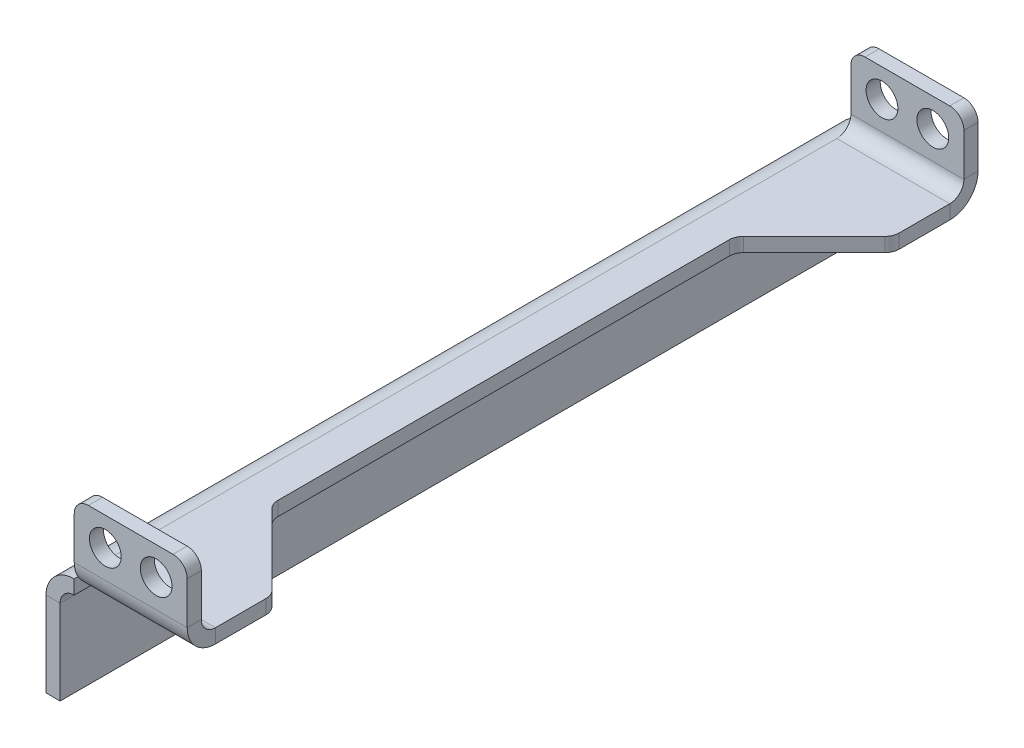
ISO-10303-21;
HEADER;
FILE_DESCRIPTION(('STEP AP214'),'2;1');
FILE_NAME('part.step','',(''),(''),'','','');
FILE_SCHEMA(('AUTOMOTIVE_DESIGN { 1 0 10303 214 1 1 1 1 }'));
ENDSEC;
DATA;
#1=APPLICATION_CONTEXT('core data for automotive mechanical design processes');
#2=APPLICATION_PROTOCOL_DEFINITION('international standard','automotive_design',2000,#1);
#3=PRODUCT_CONTEXT('',#1,'mechanical');
#4=PRODUCT('Part','Part','',(#3));
#5=PRODUCT_RELATED_PRODUCT_CATEGORY('part','',(#4));
#6=PRODUCT_DEFINITION_FORMATION('','',#4);
#7=PRODUCT_DEFINITION_CONTEXT('part definition',#1,'design');
#8=PRODUCT_DEFINITION('design','',#6,#7);
#9=PRODUCT_DEFINITION_SHAPE('','',#8);
#10=(LENGTH_UNIT() NAMED_UNIT(*) SI_UNIT(.MILLI.,.METRE.));
#11=(NAMED_UNIT(*) PLANE_ANGLE_UNIT() SI_UNIT($,.RADIAN.));
#12=(NAMED_UNIT(*) SI_UNIT($,.STERADIAN.) SOLID_ANGLE_UNIT());
#13=UNCERTAINTY_MEASURE_WITH_UNIT(LENGTH_MEASURE(1.E-05),#10,'distance_accuracy_value','');
#14=(GEOMETRIC_REPRESENTATION_CONTEXT(3) GLOBAL_UNCERTAINTY_ASSIGNED_CONTEXT((#13)) GLOBAL_UNIT_ASSIGNED_CONTEXT((#10,
#11,#12)) REPRESENTATION_CONTEXT('',''));
#15=CARTESIAN_POINT('',(0.,0.,0.));
#16=DIRECTION('',(0.,0.,1.));
#17=DIRECTION('',(1.,0.,0.));
#18=AXIS2_PLACEMENT_3D('',#15,#16,#17);
#19=CARTESIAN_POINT('',(-1.00520085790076E-13,25.4,0.));
#20=DIRECTION('',(0.,-1.,0.));
#21=DIRECTION('',(1.,0.,0.));
#22=AXIS2_PLACEMENT_3D('',#19,#20,#21);
#23=PLANE('',#22);
#24=DIRECTION('',(0.707106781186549,0.,-0.707106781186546));
#25=VECTOR('',#24,1.);
#26=CARTESIAN_POINT('',(-19.0500000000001,25.3999999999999,-19.0500000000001));
#27=LINE('',#26,#25);
#28=CARTESIAN_POINT('',(14.8999359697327,25.4,-52.9999359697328));
#29=VERTEX_POINT('',#28);
#30=CARTESIAN_POINT('',(30.8200640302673,25.4000000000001,-68.9200640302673));
#31=VERTEX_POINT('',#30);
#32=EDGE_CURVE('E761',#29,#31,#27,.T.);
#33=ORIENTED_EDGE('',*,*,#32,.T.);
#34=CARTESIAN_POINT('',(28.575,25.4000000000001,-71.1651280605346));
#35=DIRECTION('',(0.,-1.,0.));
#36=DIRECTION('',(1.,0.,0.));
#37=AXIS2_PLACEMENT_3D('',#34,#35,#36);
#38=CIRCLE('',#37,3.175);
#39=CARTESIAN_POINT('',(31.75,25.4000000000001,-71.1651280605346));
#40=VERTEX_POINT('',#39);
#41=EDGE_CURVE('E698',#31,#40,#38,.F.);
#42=ORIENTED_EDGE('',*,*,#41,.T.);
#43=DIRECTION('',(0.,0.,-1.));
#44=VECTOR('',#43,1.);
#45=CARTESIAN_POINT('',(31.75,25.4000000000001,0.));
#46=LINE('',#45,#44);
#47=CARTESIAN_POINT('',(31.75,25.4000000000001,-82.55));
#48=VERTEX_POINT('',#47);
#49=EDGE_CURVE('E544',#40,#48,#46,.T.);
#50=ORIENTED_EDGE('',*,*,#49,.T.);
#51=DIRECTION('',(-1.,0.,0.));
#52=VECTOR('',#51,1.);
#53=CARTESIAN_POINT('',(6.34999999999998,25.4,-82.55));
#54=LINE('',#53,#52);
#55=CARTESIAN_POINT('',(6.34999999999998,25.4,-82.55));
#56=VERTEX_POINT('',#55);
#57=EDGE_CURVE('E519',#56,#48,#54,.F.);
#58=ORIENTED_EDGE('',*,*,#57,.F.);
#59=DIRECTION('',(0.,0.,1.));
#60=VECTOR('',#59,1.);
#61=CARTESIAN_POINT('',(6.34999999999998,25.4,-88.9));
#62=LINE('',#61,#60);
#63=CARTESIAN_POINT('',(6.34999999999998,25.4,82.55));
#64=VERTEX_POINT('',#63);
#65=EDGE_CURVE('E555',#64,#56,#62,.F.);
#66=ORIENTED_EDGE('',*,*,#65,.F.);
#67=DIRECTION('',(1.,0.,0.));
#68=VECTOR('',#67,1.);
#69=CARTESIAN_POINT('',(31.75,25.4000000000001,82.55));
#70=LINE('',#69,#68);
#71=CARTESIAN_POINT('',(31.75,25.4000000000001,82.55));
#72=VERTEX_POINT('',#71);
#73=EDGE_CURVE('E455',#72,#64,#70,.F.);
#74=ORIENTED_EDGE('',*,*,#73,.F.);
#75=CARTESIAN_POINT('',(31.75,25.4000000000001,71.1651280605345));
#76=VERTEX_POINT('',#75);
#77=EDGE_CURVE('E539',#72,#76,#46,.T.);
#78=ORIENTED_EDGE('',*,*,#77,.T.);
#79=CARTESIAN_POINT('',(28.575,25.4000000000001,71.1651280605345));
#80=DIRECTION('',(0.,-1.,0.));
#81=DIRECTION('',(1.,0.,0.));
#82=AXIS2_PLACEMENT_3D('',#79,#80,#81);
#83=CIRCLE('',#82,3.175);
#84=CARTESIAN_POINT('',(30.8200640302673,25.4000000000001,68.9200640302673));
#85=VERTEX_POINT('',#84);
#86=EDGE_CURVE('E695',#76,#85,#83,.F.);
#87=ORIENTED_EDGE('',*,*,#86,.T.);
#88=DIRECTION('',(-0.707106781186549,0.,-0.707106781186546));
#89=VECTOR('',#88,1.);
#90=CARTESIAN_POINT('',(-19.0500000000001,25.3999999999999,19.0500000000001));
#91=LINE('',#90,#89);
#92=CARTESIAN_POINT('',(14.8999359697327,25.4,52.9999359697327));
#93=VERTEX_POINT('',#92);
#94=EDGE_CURVE('E734',#85,#93,#91,.T.);
#95=ORIENTED_EDGE('',*,*,#94,.T.);
#96=CARTESIAN_POINT('',(17.145,25.4,50.7548719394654));
#97=DIRECTION('',(0.,-1.,0.));
#98=DIRECTION('',(1.,0.,0.));
#99=AXIS2_PLACEMENT_3D('',#96,#97,#98);
#100=CIRCLE('',#99,3.175);
#101=CARTESIAN_POINT('',(13.97,25.4,50.7548719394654));
#102=VERTEX_POINT('',#101);
#103=EDGE_CURVE('E13',#93,#102,#100,.T.);
#104=ORIENTED_EDGE('',*,*,#103,.T.);
#105=DIRECTION('',(0.,0.,-1.));
#106=VECTOR('',#105,1.);
#107=CARTESIAN_POINT('',(13.97,25.4,0.));
#108=LINE('',#107,#106);
#109=CARTESIAN_POINT('',(13.97,25.4,-50.7548719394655));
#110=VERTEX_POINT('',#109);
#111=EDGE_CURVE('E753',#102,#110,#108,.T.);
#112=ORIENTED_EDGE('',*,*,#111,.T.);
#113=CARTESIAN_POINT('',(17.145,25.4,-50.7548719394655));
#114=DIRECTION('',(0.,-1.,0.));
#115=DIRECTION('',(1.,0.,0.));
#116=AXIS2_PLACEMENT_3D('',#113,#114,#115);
#117=CIRCLE('',#116,3.175);
#118=EDGE_CURVE('E720',#110,#29,#117,.T.);
#119=ORIENTED_EDGE('',*,*,#118,.T.);
#120=EDGE_LOOP('',(#33,#42,#50,#58,#66,#74,#78,#87,#95,#104,#112,#119));
#121=FACE_BOUND('',#120,.T.);
#122=ADVANCED_FACE('F108',(#121),#23,.F.);
#123=CARTESIAN_POINT('',(0.,22.225,0.));
#124=DIRECTION('',(0.,-1.,0.));
#125=DIRECTION('',(1.,0.,0.));
#126=AXIS2_PLACEMENT_3D('',#123,#124,#125);
#127=PLANE('',#126);
#128=DIRECTION('',(0.,0.,1.));
#129=VECTOR('',#128,1.);
#130=CARTESIAN_POINT('',(31.75,22.2250000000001,-88.9));
#131=LINE('',#130,#129);
#132=CARTESIAN_POINT('',(31.75,22.2250000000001,-71.1651280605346));
#133=VERTEX_POINT('',#132);
#134=CARTESIAN_POINT('',(31.75,22.2250000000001,-82.55));
#135=VERTEX_POINT('',#134);
#136=EDGE_CURVE('E549',#133,#135,#131,.F.);
#137=ORIENTED_EDGE('',*,*,#136,.F.);
#138=CARTESIAN_POINT('',(28.575,22.2250000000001,-71.1651280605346));
#139=DIRECTION('',(0.,-1.,0.));
#140=DIRECTION('',(1.,0.,0.));
#141=AXIS2_PLACEMENT_3D('',#138,#139,#140);
#142=CIRCLE('',#141,3.175);
#143=CARTESIAN_POINT('',(30.8200640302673,22.2250000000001,-68.9200640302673));
#144=VERTEX_POINT('',#143);
#145=EDGE_CURVE('E685',#133,#144,#142,.T.);
#146=ORIENTED_EDGE('',*,*,#145,.T.);
#147=DIRECTION('',(0.707106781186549,0.,-0.707106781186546));
#148=VECTOR('',#147,1.);
#149=CARTESIAN_POINT('',(-19.0500000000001,22.2249999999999,-19.0500000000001));
#150=LINE('',#149,#148);
#151=CARTESIAN_POINT('',(14.8999359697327,22.225,-52.9999359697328));
#152=VERTEX_POINT('',#151);
#153=EDGE_CURVE('E752',#152,#144,#150,.T.);
#154=ORIENTED_EDGE('',*,*,#153,.F.);
#155=CARTESIAN_POINT('',(17.145,22.225,-50.7548719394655));
#156=DIRECTION('',(0.,-1.,0.));
#157=DIRECTION('',(1.,0.,0.));
#158=AXIS2_PLACEMENT_3D('',#155,#156,#157);
#159=CIRCLE('',#158,3.175);
#160=CARTESIAN_POINT('',(13.97,22.225,-50.7548719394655));
#161=VERTEX_POINT('',#160);
#162=EDGE_CURVE('E717',#152,#161,#159,.F.);
#163=ORIENTED_EDGE('',*,*,#162,.T.);
#164=DIRECTION('',(0.,0.,1.));
#165=VECTOR('',#164,1.);
#166=CARTESIAN_POINT('',(13.97,22.225,0.));
#167=LINE('',#166,#165);
#168=CARTESIAN_POINT('',(13.97,22.225,50.7548719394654));
#169=VERTEX_POINT('',#168);
#170=EDGE_CURVE('E443',#169,#161,#167,.F.);
#171=ORIENTED_EDGE('',*,*,#170,.F.);
#172=CARTESIAN_POINT('',(17.145,22.225,50.7548719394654));
#173=DIRECTION('',(0.,-1.,0.));
#174=DIRECTION('',(1.,0.,0.));
#175=AXIS2_PLACEMENT_3D('',#172,#173,#174);
#176=CIRCLE('',#175,3.175);
#177=CARTESIAN_POINT('',(14.8999359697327,22.225,52.9999359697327));
#178=VERTEX_POINT('',#177);
#179=EDGE_CURVE('E118',#169,#178,#176,.F.);
#180=ORIENTED_EDGE('',*,*,#179,.T.);
#181=DIRECTION('',(-0.707106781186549,0.,-0.707106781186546));
#182=VECTOR('',#181,1.);
#183=CARTESIAN_POINT('',(-19.0500000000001,22.2249999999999,19.0500000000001));
#184=LINE('',#183,#182);
#185=CARTESIAN_POINT('',(30.8200640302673,22.2250000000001,68.9200640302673));
#186=VERTEX_POINT('',#185);
#187=EDGE_CURVE('E748',#186,#178,#184,.T.);
#188=ORIENTED_EDGE('',*,*,#187,.F.);
#189=CARTESIAN_POINT('',(28.575,22.2250000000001,71.1651280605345));
#190=DIRECTION('',(0.,-1.,0.));
#191=DIRECTION('',(1.,0.,0.));
#192=AXIS2_PLACEMENT_3D('',#189,#190,#191);
#193=CIRCLE('',#192,3.175);
#194=CARTESIAN_POINT('',(31.75,22.2250000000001,71.1651280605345));
#195=VERTEX_POINT('',#194);
#196=EDGE_CURVE('E682',#186,#195,#193,.T.);
#197=ORIENTED_EDGE('',*,*,#196,.T.);
#198=CARTESIAN_POINT('',(31.75,22.2250000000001,82.55));
#199=VERTEX_POINT('',#198);
#200=EDGE_CURVE('E545',#199,#195,#131,.F.);
#201=ORIENTED_EDGE('',*,*,#200,.F.);
#202=DIRECTION('',(1.,0.,0.));
#203=VECTOR('',#202,1.);
#204=CARTESIAN_POINT('',(31.75,22.2250000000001,82.55));
#205=LINE('',#204,#203);
#206=CARTESIAN_POINT('',(6.34999999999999,22.225,82.55));
#207=VERTEX_POINT('',#206);
#208=EDGE_CURVE('E384',#199,#207,#205,.F.);
#209=ORIENTED_EDGE('',*,*,#208,.T.);
#210=DIRECTION('',(0.,0.,1.));
#211=VECTOR('',#210,1.);
#212=CARTESIAN_POINT('',(6.34999999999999,22.225,-88.9));
#213=LINE('',#212,#211);
#214=CARTESIAN_POINT('',(6.34999999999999,22.225,-82.55));
#215=VERTEX_POINT('',#214);
#216=EDGE_CURVE('E564',#215,#207,#213,.T.);
#217=ORIENTED_EDGE('',*,*,#216,.F.);
#218=DIRECTION('',(-1.,0.,0.));
#219=VECTOR('',#218,1.);
#220=CARTESIAN_POINT('',(6.34999999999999,22.225,-82.55));
#221=LINE('',#220,#219);
#222=EDGE_CURVE('E501',#215,#135,#221,.F.);
#223=ORIENTED_EDGE('',*,*,#222,.T.);
#224=EDGE_LOOP('',(#137,#146,#154,#163,#171,#180,#188,#197,#201,#209,#217,#223));
#225=FACE_BOUND('',#224,.T.);
#226=ADVANCED_FACE('F777',(#225),#127,.T.);
#227=CARTESIAN_POINT('',(31.75,25.4000000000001,-88.9));
#228=DIRECTION('',(-1.,0.,0.));
#229=DIRECTION('',(0.,-1.,0.));
#230=AXIS2_PLACEMENT_3D('',#227,#228,#229);
#231=PLANE('',#230);
#232=ORIENTED_EDGE('',*,*,#49,.F.);
#233=DIRECTION('',(0.,1.,0.));
#234=VECTOR('',#233,1.);
#235=CARTESIAN_POINT('',(31.75,22.2250000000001,-71.1651280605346));
#236=LINE('',#235,#234);
#237=EDGE_CURVE('E678',#40,#133,#236,.F.);
#238=ORIENTED_EDGE('',*,*,#237,.T.);
#239=ORIENTED_EDGE('',*,*,#136,.T.);
#240=DIRECTION('',(0.,-1.,0.));
#241=VECTOR('',#240,1.);
#242=CARTESIAN_POINT('',(31.75,25.4000000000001,-82.55));
#243=LINE('',#242,#241);
#244=EDGE_CURVE('E510',#48,#135,#243,.T.);
#245=ORIENTED_EDGE('',*,*,#244,.F.);
#246=EDGE_LOOP('',(#232,#238,#239,#245));
#247=FACE_BOUND('',#246,.T.);
#248=ADVANCED_FACE('F785',(#247),#231,.F.);
#249=ORIENTED_EDGE('',*,*,#200,.T.);
#250=DIRECTION('',(0.,1.,0.));
#251=VECTOR('',#250,1.);
#252=CARTESIAN_POINT('',(31.75,25.4000000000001,71.1651280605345));
#253=LINE('',#252,#251);
#254=EDGE_CURVE('E714',#195,#76,#253,.T.);
#255=ORIENTED_EDGE('',*,*,#254,.T.);
#256=ORIENTED_EDGE('',*,*,#77,.F.);
#257=DIRECTION('',(0.,-1.,0.));
#258=VECTOR('',#257,1.);
#259=CARTESIAN_POINT('',(31.75,25.4000000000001,82.55));
#260=LINE('',#259,#258);
#261=EDGE_CURVE('E450',#72,#199,#260,.T.);
#262=ORIENTED_EDGE('',*,*,#261,.T.);
#263=EDGE_LOOP('',(#249,#255,#256,#262));
#264=FACE_BOUND('',#263,.T.);
#265=ADVANCED_FACE('F900',(#264),#231,.F.);
#266=CARTESIAN_POINT('',(6.34999999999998,25.4,82.55));
#267=DIRECTION('',(1.,0.,0.));
#268=DIRECTION('',(0.,1.,0.));
#269=AXIS2_PLACEMENT_3D('',#266,#267,#268);
#270=PLANE('',#269);
#271=DIRECTION('',(0.,0.,1.));
#272=VECTOR('',#271,1.);
#273=CARTESIAN_POINT('',(6.34999999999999,22.225,88.9));
#274=LINE('',#273,#272);
#275=CARTESIAN_POINT('',(6.34999999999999,22.225,88.9));
#276=VERTEX_POINT('',#275);
#277=EDGE_CURVE('E529',#276,#207,#274,.F.);
#278=ORIENTED_EDGE('',*,*,#277,.T.);
#279=CARTESIAN_POINT('',(6.34999999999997,28.575,82.55));
#280=DIRECTION('',(1.,0.,0.));
#281=DIRECTION('',(0.,1.,0.));
#282=AXIS2_PLACEMENT_3D('',#279,#280,#281);
#283=CIRCLE('',#282,6.35);
#284=CARTESIAN_POINT('',(6.34999999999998,25.4,88.0492613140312));
#285=VERTEX_POINT('',#284);
#286=EDGE_CURVE('E447',#207,#285,#283,.F.);
#287=ORIENTED_EDGE('',*,*,#286,.T.);
#288=CARTESIAN_POINT('',(6.34999999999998,25.4,88.9));
#289=VERTEX_POINT('',#288);
#290=EDGE_CURVE('E550',#289,#285,#62,.F.);
#291=ORIENTED_EDGE('',*,*,#290,.F.);
#292=DIRECTION('',(0.,-1.,0.));
#293=VECTOR('',#292,1.);
#294=CARTESIAN_POINT('',(6.34999999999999,22.225,88.9));
#295=LINE('',#294,#293);
#296=EDGE_CURVE('E556',#276,#289,#295,.F.);
#297=ORIENTED_EDGE('',*,*,#296,.F.);
#298=EDGE_LOOP('',(#278,#287,#291,#297));
#299=FACE_BOUND('',#298,.T.);
#300=ADVANCED_FACE('F990',(#299),#270,.T.);
#301=CARTESIAN_POINT('',(6.34999999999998,25.4,-88.9));
#302=DIRECTION('',(1.,0.,0.));
#303=DIRECTION('',(0.,1.,0.));
#304=AXIS2_PLACEMENT_3D('',#301,#302,#303);
#305=PLANE('',#304);
#306=DIRECTION('',(0.,0.,1.));
#307=VECTOR('',#306,1.);
#308=CARTESIAN_POINT('',(6.34999999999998,25.4,-88.9));
#309=LINE('',#308,#307);
#310=CARTESIAN_POINT('',(6.34999999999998,25.4,-88.9));
#311=VERTEX_POINT('',#310);
#312=CARTESIAN_POINT('',(6.34999999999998,25.4,-88.0492613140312));
#313=VERTEX_POINT('',#312);
#314=EDGE_CURVE('E534',#311,#313,#309,.T.);
#315=ORIENTED_EDGE('',*,*,#314,.T.);
#316=CARTESIAN_POINT('',(6.34999999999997,28.575,-82.55));
#317=DIRECTION('',(-1.,0.,0.));
#318=DIRECTION('',(0.,-1.,0.));
#319=AXIS2_PLACEMENT_3D('',#316,#317,#318);
#320=CIRCLE('',#319,6.35);
#321=EDGE_CURVE('E515',#313,#215,#320,.T.);
#322=ORIENTED_EDGE('',*,*,#321,.T.);
#323=CARTESIAN_POINT('',(6.34999999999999,22.225,-88.9));
#324=VERTEX_POINT('',#323);
#325=EDGE_CURVE('E560',#324,#215,#213,.T.);
#326=ORIENTED_EDGE('',*,*,#325,.F.);
#327=DIRECTION('',(0.,-1.,0.));
#328=VECTOR('',#327,1.);
#329=CARTESIAN_POINT('',(6.34999999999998,25.4,-88.9));
#330=LINE('',#329,#328);
#331=EDGE_CURVE('E538',#324,#311,#330,.F.);
#332=ORIENTED_EDGE('',*,*,#331,.T.);
#333=EDGE_LOOP('',(#315,#322,#326,#332));
#334=FACE_BOUND('',#333,.T.);
#335=ADVANCED_FACE('F895',(#334),#305,.T.);
#336=CARTESIAN_POINT('',(3.175,0.,88.9));
#337=DIRECTION('',(-1.,0.,0.));
#338=DIRECTION('',(0.,0.,1.));
#339=AXIS2_PLACEMENT_3D('',#336,#337,#338);
#340=PLANE('',#339);
#341=DIRECTION('',(0.,0.,1.));
#342=VECTOR('',#341,1.);
#343=CARTESIAN_POINT('',(3.175,19.05,88.9));
#344=LINE('',#343,#342);
#345=CARTESIAN_POINT('',(3.175,19.05,88.9));
#346=VERTEX_POINT('',#345);
#347=CARTESIAN_POINT('',(3.175,19.05,-88.9));
#348=VERTEX_POINT('',#347);
#349=EDGE_CURVE('E585',#346,#348,#344,.F.);
#350=ORIENTED_EDGE('',*,*,#349,.F.);
#351=DIRECTION('',(0.,1.,0.));
#352=VECTOR('',#351,1.);
#353=CARTESIAN_POINT('',(3.175,0.,88.9));
#354=LINE('',#353,#352);
#355=CARTESIAN_POINT('',(3.175,0.,88.9));
#356=VERTEX_POINT('',#355);
#357=EDGE_CURVE('E599',#356,#346,#354,.T.);
#358=ORIENTED_EDGE('',*,*,#357,.F.);
#359=DIRECTION('',(0.,0.,-1.));
#360=VECTOR('',#359,1.);
#361=CARTESIAN_POINT('',(3.175,0.,88.9));
#362=LINE('',#361,#360);
#363=CARTESIAN_POINT('',(3.175,0.,-88.9));
#364=VERTEX_POINT('',#363);
#365=EDGE_CURVE('E612',#356,#364,#362,.T.);
#366=ORIENTED_EDGE('',*,*,#365,.T.);
#367=DIRECTION('',(0.,1.,0.));
#368=VECTOR('',#367,1.);
#369=CARTESIAN_POINT('',(3.175,0.,-88.9));
#370=LINE('',#369,#368);
#371=EDGE_CURVE('E595',#364,#348,#370,.T.);
#372=ORIENTED_EDGE('',*,*,#371,.T.);
#373=EDGE_LOOP('',(#350,#358,#366,#372));
#374=FACE_BOUND('',#373,.T.);
#375=ADVANCED_FACE('F930',(#374),#340,.F.);
#376=CARTESIAN_POINT('',(0.,0.,88.9));
#377=DIRECTION('',(-1.,0.,0.));
#378=DIRECTION('',(0.,0.,1.));
#379=AXIS2_PLACEMENT_3D('',#376,#377,#378);
#380=PLANE('',#379);
#381=DIRECTION('',(0.,1.,0.));
#382=VECTOR('',#381,1.);
#383=CARTESIAN_POINT('',(0.,0.,88.9));
#384=LINE('',#383,#382);
#385=CARTESIAN_POINT('',(0.,0.,88.9));
#386=VERTEX_POINT('',#385);
#387=CARTESIAN_POINT('',(0.,19.05,88.9));
#388=VERTEX_POINT('',#387);
#389=EDGE_CURVE('E603',#386,#388,#384,.T.);
#390=ORIENTED_EDGE('',*,*,#389,.T.);
#391=DIRECTION('',(0.,0.,1.));
#392=VECTOR('',#391,1.);
#393=CARTESIAN_POINT('',(0.,19.05,88.9));
#394=LINE('',#393,#392);
#395=CARTESIAN_POINT('',(0.,19.05,-88.9));
#396=VERTEX_POINT('',#395);
#397=EDGE_CURVE('E568',#388,#396,#394,.F.);
#398=ORIENTED_EDGE('',*,*,#397,.T.);
#399=DIRECTION('',(0.,1.,0.));
#400=VECTOR('',#399,1.);
#401=CARTESIAN_POINT('',(0.,0.,-88.9));
#402=LINE('',#401,#400);
#403=CARTESIAN_POINT('',(0.,0.,-88.9));
#404=VERTEX_POINT('',#403);
#405=EDGE_CURVE('E616',#404,#396,#402,.T.);
#406=ORIENTED_EDGE('',*,*,#405,.F.);
#407=DIRECTION('',(0.,0.,-1.));
#408=VECTOR('',#407,1.);
#409=CARTESIAN_POINT('',(0.,0.,88.9));
#410=LINE('',#409,#408);
#411=EDGE_CURVE('E625',#386,#404,#410,.T.);
#412=ORIENTED_EDGE('',*,*,#411,.F.);
#413=EDGE_LOOP('',(#390,#398,#406,#412));
#414=FACE_BOUND('',#413,.T.);
#415=ADVANCED_FACE('F920',(#414),#380,.T.);
#416=CARTESIAN_POINT('',(0.,0.,88.9));
#417=DIRECTION('',(0.,0.,-1.));
#418=DIRECTION('',(-1.,0.,0.));
#419=AXIS2_PLACEMENT_3D('',#416,#417,#418);
#420=PLANE('',#419);
#421=DIRECTION('',(-1.,0.,0.));
#422=VECTOR('',#421,1.);
#423=CARTESIAN_POINT('',(3.175,19.05,88.9));
#424=LINE('',#423,#422);
#425=EDGE_CURVE('E577',#346,#388,#424,.T.);
#426=ORIENTED_EDGE('',*,*,#425,.T.);
#427=ORIENTED_EDGE('',*,*,#389,.F.);
#428=DIRECTION('',(-1.,0.,0.));
#429=VECTOR('',#428,1.);
#430=CARTESIAN_POINT('',(3.175,0.,88.9));
#431=LINE('',#430,#429);
#432=EDGE_CURVE('E608',#356,#386,#431,.T.);
#433=ORIENTED_EDGE('',*,*,#432,.F.);
#434=ORIENTED_EDGE('',*,*,#357,.T.);
#435=EDGE_LOOP('',(#426,#427,#433,#434));
#436=FACE_BOUND('',#435,.T.);
#437=ADVANCED_FACE('F916',(#436),#420,.F.);
#438=CARTESIAN_POINT('',(3.175,0.,88.9));
#439=DIRECTION('',(0.,-1.,0.));
#440=DIRECTION('',(0.,0.,-1.));
#441=AXIS2_PLACEMENT_3D('',#438,#439,#440);
#442=PLANE('',#441);
#443=DIRECTION('',(-1.,0.,0.));
#444=VECTOR('',#443,1.);
#445=CARTESIAN_POINT('',(3.175,0.,-88.9));
#446=LINE('',#445,#444);
#447=EDGE_CURVE('E604',#364,#404,#446,.T.);
#448=ORIENTED_EDGE('',*,*,#447,.F.);
#449=ORIENTED_EDGE('',*,*,#365,.F.);
#450=ORIENTED_EDGE('',*,*,#432,.T.);
#451=ORIENTED_EDGE('',*,*,#411,.T.);
#452=EDGE_LOOP('',(#448,#449,#450,#451));
#453=FACE_BOUND('',#452,.T.);
#454=ADVANCED_FACE('F919',(#453),#442,.T.);
#455=CARTESIAN_POINT('',(0.,0.,-88.9));
#456=DIRECTION('',(0.,0.,-1.));
#457=DIRECTION('',(-1.,0.,0.));
#458=AXIS2_PLACEMENT_3D('',#455,#456,#457);
#459=PLANE('',#458);
#460=DIRECTION('',(-1.,0.,0.));
#461=VECTOR('',#460,1.);
#462=CARTESIAN_POINT('',(3.175,19.05,-88.9));
#463=LINE('',#462,#461);
#464=EDGE_CURVE('E591',#348,#396,#463,.T.);
#465=ORIENTED_EDGE('',*,*,#464,.F.);
#466=ORIENTED_EDGE('',*,*,#371,.F.);
#467=ORIENTED_EDGE('',*,*,#447,.T.);
#468=ORIENTED_EDGE('',*,*,#405,.T.);
#469=EDGE_LOOP('',(#465,#466,#467,#468));
#470=FACE_BOUND('',#469,.T.);
#471=ADVANCED_FACE('F911',(#470),#459,.T.);
#472=CARTESIAN_POINT('',(6.35,19.05,-88.9));
#473=DIRECTION('',(0.,0.,-1.));
#474=DIRECTION('',(-1.,0.,0.));
#475=AXIS2_PLACEMENT_3D('',#472,#473,#474);
#476=PLANE('',#475);
#477=ORIENTED_EDGE('',*,*,#331,.F.);
#478=CARTESIAN_POINT('',(6.35,19.05,-88.9));
#479=DIRECTION('',(0.,0.,1.));
#480=DIRECTION('',(1.,0.,0.));
#481=AXIS2_PLACEMENT_3D('',#478,#479,#480);
#482=CIRCLE('',#481,3.175);
#483=EDGE_CURVE('E581',#348,#324,#482,.F.);
#484=ORIENTED_EDGE('',*,*,#483,.F.);
#485=ORIENTED_EDGE('',*,*,#464,.T.);
#486=CARTESIAN_POINT('',(6.35,19.05,-88.9));
#487=DIRECTION('',(0.,0.,1.));
#488=DIRECTION('',(1.,0.,0.));
#489=AXIS2_PLACEMENT_3D('',#486,#487,#488);
#490=CIRCLE('',#489,6.35);
#491=EDGE_CURVE('E572',#396,#311,#490,.F.);
#492=ORIENTED_EDGE('',*,*,#491,.T.);
#493=EDGE_LOOP('',(#477,#484,#485,#492));
#494=FACE_BOUND('',#493,.T.);
#495=ADVANCED_FACE('F908',(#494),#476,.T.);
#496=CARTESIAN_POINT('',(6.35,19.05,88.9));
#497=DIRECTION('',(0.,0.,-1.));
#498=DIRECTION('',(-1.,0.,0.));
#499=AXIS2_PLACEMENT_3D('',#496,#497,#498);
#500=PLANE('',#499);
#501=CARTESIAN_POINT('',(6.35,19.05,88.9));
#502=DIRECTION('',(0.,0.,1.));
#503=DIRECTION('',(1.,0.,0.));
#504=AXIS2_PLACEMENT_3D('',#501,#502,#503);
#505=CIRCLE('',#504,3.175);
#506=EDGE_CURVE('E543',#276,#346,#505,.T.);
#507=ORIENTED_EDGE('',*,*,#506,.F.);
#508=ORIENTED_EDGE('',*,*,#296,.T.);
#509=CARTESIAN_POINT('',(6.35,19.05,88.9));
#510=DIRECTION('',(0.,0.,1.));
#511=DIRECTION('',(1.,0.,0.));
#512=AXIS2_PLACEMENT_3D('',#509,#510,#511);
#513=CIRCLE('',#512,6.35);
#514=EDGE_CURVE('E573',#289,#388,#513,.T.);
#515=ORIENTED_EDGE('',*,*,#514,.T.);
#516=ORIENTED_EDGE('',*,*,#425,.F.);
#517=EDGE_LOOP('',(#507,#508,#515,#516));
#518=FACE_BOUND('',#517,.T.);
#519=ADVANCED_FACE('F904',(#518),#500,.F.);
#520=CARTESIAN_POINT('',(6.35,19.05,88.9));
#521=DIRECTION('',(0.,0.,1.));
#522=DIRECTION('',(0.,1.,0.));
#523=AXIS2_PLACEMENT_3D('',#520,#521,#522);
#524=CYLINDRICAL_SURFACE('',#523,6.35);
#525=ORIENTED_EDGE('',*,*,#397,.F.);
#526=ORIENTED_EDGE('',*,*,#514,.F.);
#527=ORIENTED_EDGE('',*,*,#290,.T.);
#528=EDGE_CURVE('E554',#285,#64,#62,.F.);
#529=ORIENTED_EDGE('',*,*,#528,.T.);
#530=ORIENTED_EDGE('',*,*,#65,.T.);
#531=EDGE_CURVE('E533',#313,#56,#309,.T.);
#532=ORIENTED_EDGE('',*,*,#531,.F.);
#533=ORIENTED_EDGE('',*,*,#314,.F.);
#534=ORIENTED_EDGE('',*,*,#491,.F.);
#535=EDGE_LOOP('',(#525,#526,#527,#529,#530,#532,#533,#534));
#536=FACE_BOUND('',#535,.T.);
#537=ADVANCED_FACE('F834',(#536),#524,.T.);
#538=CARTESIAN_POINT('',(6.35,19.05,88.9));
#539=DIRECTION('',(0.,0.,1.));
#540=DIRECTION('',(0.,1.,0.));
#541=AXIS2_PLACEMENT_3D('',#538,#539,#540);
#542=CYLINDRICAL_SURFACE('',#541,3.175);
#543=ORIENTED_EDGE('',*,*,#349,.T.);
#544=ORIENTED_EDGE('',*,*,#483,.T.);
#545=ORIENTED_EDGE('',*,*,#325,.T.);
#546=ORIENTED_EDGE('',*,*,#216,.T.);
#547=ORIENTED_EDGE('',*,*,#277,.F.);
#548=ORIENTED_EDGE('',*,*,#506,.T.);
#549=EDGE_LOOP('',(#543,#544,#545,#546,#547,#548));
#550=FACE_BOUND('',#549,.T.);
#551=ADVANCED_FACE('F903',(#550),#542,.F.);
#552=CARTESIAN_POINT('',(31.75,28.5750000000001,-82.55));
#553=DIRECTION('',(1.,0.,0.));
#554=DIRECTION('',(0.,1.,0.));
#555=AXIS2_PLACEMENT_3D('',#552,#553,#554);
#556=PLANE('',#555);
#557=DIRECTION('',(0.,0.,1.));
#558=VECTOR('',#557,1.);
#559=CARTESIAN_POINT('',(31.75,28.5750000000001,-88.9));
#560=LINE('',#559,#558);
#561=CARTESIAN_POINT('',(31.75,28.5750000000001,-85.725));
#562=VERTEX_POINT('',#561);
#563=CARTESIAN_POINT('',(31.75,28.575,-88.9));
#564=VERTEX_POINT('',#563);
#565=EDGE_CURVE('E463',#562,#564,#560,.F.);
#566=ORIENTED_EDGE('',*,*,#565,.F.);
#567=CARTESIAN_POINT('',(31.75,28.5750000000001,-82.55));
#568=DIRECTION('',(-1.,0.,0.));
#569=DIRECTION('',(0.,-1.,0.));
#570=AXIS2_PLACEMENT_3D('',#567,#568,#569);
#571=CIRCLE('',#570,3.175);
#572=EDGE_CURVE('E514',#48,#562,#571,.F.);
#573=ORIENTED_EDGE('',*,*,#572,.F.);
#574=ORIENTED_EDGE('',*,*,#244,.T.);
#575=CARTESIAN_POINT('',(31.75,28.5750000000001,-82.55));
#576=DIRECTION('',(-1.,0.,0.));
#577=DIRECTION('',(0.,-1.,0.));
#578=AXIS2_PLACEMENT_3D('',#575,#576,#577);
#579=CIRCLE('',#578,6.35);
#580=EDGE_CURVE('E505',#135,#564,#579,.F.);
#581=ORIENTED_EDGE('',*,*,#580,.T.);
#582=EDGE_LOOP('',(#566,#573,#574,#581));
#583=FACE_BOUND('',#582,.T.);
#584=ADVANCED_FACE('F845',(#583),#556,.T.);
#585=CARTESIAN_POINT('',(6.34999999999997,28.575,-82.55));
#586=DIRECTION('',(1.,0.,0.));
#587=DIRECTION('',(0.,1.,0.));
#588=AXIS2_PLACEMENT_3D('',#585,#586,#587);
#589=PLANE('',#588);
#590=CARTESIAN_POINT('',(6.34999999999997,28.575,-88.9));
#591=VERTEX_POINT('',#590);
#592=EDGE_CURVE('E506',#591,#313,#320,.T.);
#593=ORIENTED_EDGE('',*,*,#592,.T.);
#594=ORIENTED_EDGE('',*,*,#531,.T.);
#595=CARTESIAN_POINT('',(6.34999999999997,28.575,-82.55));
#596=DIRECTION('',(-1.,0.,0.));
#597=DIRECTION('',(0.,-1.,0.));
#598=AXIS2_PLACEMENT_3D('',#595,#596,#597);
#599=CIRCLE('',#598,3.175);
#600=CARTESIAN_POINT('',(6.34999999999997,28.575,-85.725));
#601=VERTEX_POINT('',#600);
#602=EDGE_CURVE('E467',#601,#56,#599,.T.);
#603=ORIENTED_EDGE('',*,*,#602,.F.);
#604=DIRECTION('',(0.,0.,1.));
#605=VECTOR('',#604,1.);
#606=CARTESIAN_POINT('',(6.34999999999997,28.575,-85.725));
#607=LINE('',#606,#605);
#608=EDGE_CURVE('E491',#601,#591,#607,.F.);
#609=ORIENTED_EDGE('',*,*,#608,.T.);
#610=EDGE_LOOP('',(#593,#594,#603,#609));
#611=FACE_BOUND('',#610,.T.);
#612=ADVANCED_FACE('F858',(#611),#589,.F.);
#613=CARTESIAN_POINT('',(6.34999999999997,28.575,-82.55));
#614=DIRECTION('',(-1.,0.,0.));
#615=DIRECTION('',(0.,0.,-1.));
#616=AXIS2_PLACEMENT_3D('',#613,#614,#615);
#617=CYLINDRICAL_SURFACE('',#616,6.35);
#618=ORIENTED_EDGE('',*,*,#222,.F.);
#619=ORIENTED_EDGE('',*,*,#321,.F.);
#620=ORIENTED_EDGE('',*,*,#592,.F.);
#621=DIRECTION('',(-1.,0.,0.));
#622=VECTOR('',#621,1.);
#623=CARTESIAN_POINT('',(31.75,28.5750000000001,-88.9));
#624=LINE('',#623,#622);
#625=EDGE_CURVE('E487',#591,#564,#624,.F.);
#626=ORIENTED_EDGE('',*,*,#625,.T.);
#627=ORIENTED_EDGE('',*,*,#580,.F.);
#628=EDGE_LOOP('',(#618,#619,#620,#626,#627));
#629=FACE_BOUND('',#628,.T.);
#630=ADVANCED_FACE('F981',(#629),#617,.T.);
#631=CARTESIAN_POINT('',(6.34999999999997,28.575,-82.55));
#632=DIRECTION('',(-1.,0.,0.));
#633=DIRECTION('',(0.,0.,-1.));
#634=AXIS2_PLACEMENT_3D('',#631,#632,#633);
#635=CYLINDRICAL_SURFACE('',#634,3.175);
#636=ORIENTED_EDGE('',*,*,#57,.T.);
#637=ORIENTED_EDGE('',*,*,#572,.T.);
#638=DIRECTION('',(-1.,0.,0.));
#639=VECTOR('',#638,1.);
#640=CARTESIAN_POINT('',(31.75,28.5750000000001,-85.725));
#641=LINE('',#640,#639);
#642=EDGE_CURVE('E495',#562,#601,#641,.T.);
#643=ORIENTED_EDGE('',*,*,#642,.T.);
#644=ORIENTED_EDGE('',*,*,#602,.T.);
#645=EDGE_LOOP('',(#636,#637,#643,#644));
#646=FACE_BOUND('',#645,.T.);
#647=ADVANCED_FACE('F840',(#646),#635,.F.);
#648=CARTESIAN_POINT('',(6.34999999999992,41.275,-88.9));
#649=DIRECTION('',(1.,0.,0.));
#650=DIRECTION('',(0.,1.,0.));
#651=AXIS2_PLACEMENT_3D('',#648,#649,#650);
#652=PLANE('',#651);
#653=DIRECTION('',(0.,-1.,0.));
#654=VECTOR('',#653,1.);
#655=CARTESIAN_POINT('',(6.34999999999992,41.275,-85.7250000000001));
#656=LINE('',#655,#654);
#657=CARTESIAN_POINT('',(6.34999999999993,38.1,-85.725));
#658=VERTEX_POINT('',#657);
#659=EDGE_CURVE('E483',#601,#658,#656,.F.);
#660=ORIENTED_EDGE('',*,*,#659,.T.);
#661=DIRECTION('',(0.,0.,1.));
#662=VECTOR('',#661,1.);
#663=CARTESIAN_POINT('',(6.34999999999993,38.1,-88.9));
#664=LINE('',#663,#662);
#665=CARTESIAN_POINT('',(6.34999999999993,38.1,-88.9));
#666=VERTEX_POINT('',#665);
#667=EDGE_CURVE('E675',#658,#666,#664,.F.);
#668=ORIENTED_EDGE('',*,*,#667,.T.);
#669=DIRECTION('',(0.,1.,0.));
#670=VECTOR('',#669,1.);
#671=CARTESIAN_POINT('',(6.35000000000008,-2.9800871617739E-13,-88.8999999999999));
#672=LINE('',#671,#670);
#673=EDGE_CURVE('E472',#591,#666,#672,.T.);
#674=ORIENTED_EDGE('',*,*,#673,.F.);
#675=ORIENTED_EDGE('',*,*,#608,.F.);
#676=EDGE_LOOP('',(#660,#668,#674,#675));
#677=FACE_BOUND('',#676,.T.);
#678=ADVANCED_FACE('F862',(#677),#652,.F.);
#679=CARTESIAN_POINT('',(31.75,25.4000000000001,-88.9));
#680=DIRECTION('',(-1.,0.,0.));
#681=DIRECTION('',(0.,-1.,0.));
#682=AXIS2_PLACEMENT_3D('',#679,#680,#681);
#683=PLANE('',#682);
#684=DIRECTION('',(0.,-1.,0.));
#685=VECTOR('',#684,1.);
#686=CARTESIAN_POINT('',(31.7500000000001,-1.9704780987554E-13,-88.8999999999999));
#687=LINE('',#686,#685);
#688=CARTESIAN_POINT('',(31.7499999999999,38.1000000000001,-88.9));
#689=VERTEX_POINT('',#688);
#690=EDGE_CURVE('E464',#689,#564,#687,.T.);
#691=ORIENTED_EDGE('',*,*,#690,.F.);
#692=DIRECTION('',(0.,0.,1.));
#693=VECTOR('',#692,1.);
#694=CARTESIAN_POINT('',(31.7499999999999,38.1000000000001,-88.9));
#695=LINE('',#694,#693);
#696=CARTESIAN_POINT('',(31.7499999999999,38.1000000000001,-85.725));
#697=VERTEX_POINT('',#696);
#698=EDGE_CURVE('E652',#689,#697,#695,.T.);
#699=ORIENTED_EDGE('',*,*,#698,.T.);
#700=DIRECTION('',(0.,1.,0.));
#701=VECTOR('',#700,1.);
#702=CARTESIAN_POINT('',(31.75,25.4000000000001,-85.725));
#703=LINE('',#702,#701);
#704=EDGE_CURVE('E476',#697,#562,#703,.F.);
#705=ORIENTED_EDGE('',*,*,#704,.T.);
#706=ORIENTED_EDGE('',*,*,#565,.T.);
#707=EDGE_LOOP('',(#691,#699,#705,#706));
#708=FACE_BOUND('',#707,.T.);
#709=ADVANCED_FACE('F849',(#708),#683,.F.);
#710=CARTESIAN_POINT('',(0.,-3.2194790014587E-13,-88.8999999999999));
#711=DIRECTION('',(0.,0.,1.));
#712=DIRECTION('',(0.,-1.,0.));
#713=AXIS2_PLACEMENT_3D('',#710,#711,#712);
#714=PLANE('',#713);
#715=CARTESIAN_POINT('',(24.765,34.925,-88.9));
#716=DIRECTION('',(0.,0.,-1.));
#717=DIRECTION('',(0.,1.,0.));
#718=AXIS2_PLACEMENT_3D('',#715,#716,#717);
#719=CIRCLE('',#718,3.571875);
#720=CARTESIAN_POINT('',(24.765,38.496875,-88.9));
#721=VERTEX_POINT('',#720);
#722=EDGE_CURVE('E794',#721,#721,#719,.T.);
#723=ORIENTED_EDGE('',*,*,#722,.F.);
#724=EDGE_LOOP('',(#723));
#725=FACE_BOUND('',#724,.T.);
#726=CARTESIAN_POINT('',(13.335,34.925,-88.9));
#727=DIRECTION('',(0.,0.,-1.));
#728=DIRECTION('',(0.,1.,0.));
#729=AXIS2_PLACEMENT_3D('',#726,#727,#728);
#730=CIRCLE('',#729,3.571875);
#731=CARTESIAN_POINT('',(13.335,38.496875,-88.9));
#732=VERTEX_POINT('',#731);
#733=EDGE_CURVE('E738',#732,#732,#730,.T.);
#734=ORIENTED_EDGE('',*,*,#733,.F.);
#735=EDGE_LOOP('',(#734));
#736=FACE_BOUND('',#735,.T.);
#737=DIRECTION('',(1.,0.,0.));
#738=VECTOR('',#737,1.);
#739=CARTESIAN_POINT('',(-1.57859836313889E-13,41.275,-88.9));
#740=LINE('',#739,#738);
#741=CARTESIAN_POINT('',(9.52499999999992,41.275,-88.9));
#742=VERTEX_POINT('',#741);
#743=CARTESIAN_POINT('',(28.5749999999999,41.2750000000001,-88.9));
#744=VERTEX_POINT('',#743);
#745=EDGE_CURVE('E468',#742,#744,#740,.T.);
#746=ORIENTED_EDGE('',*,*,#745,.T.);
#747=CARTESIAN_POINT('',(28.5749999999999,38.1000000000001,-88.9));
#748=DIRECTION('',(0.,0.,1.));
#749=DIRECTION('',(0.,-1.,0.));
#750=AXIS2_PLACEMENT_3D('',#747,#748,#749);
#751=CIRCLE('',#750,3.175);
#752=EDGE_CURVE('E672',#744,#689,#751,.F.);
#753=ORIENTED_EDGE('',*,*,#752,.T.);
#754=ORIENTED_EDGE('',*,*,#690,.T.);
#755=ORIENTED_EDGE('',*,*,#625,.F.);
#756=ORIENTED_EDGE('',*,*,#673,.T.);
#757=CARTESIAN_POINT('',(9.52499999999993,38.1,-88.9));
#758=DIRECTION('',(0.,0.,1.));
#759=DIRECTION('',(0.,-1.,0.));
#760=AXIS2_PLACEMENT_3D('',#757,#758,#759);
#761=CIRCLE('',#760,3.175);
#762=EDGE_CURVE('E669',#666,#742,#761,.F.);
#763=ORIENTED_EDGE('',*,*,#762,.T.);
#764=EDGE_LOOP('',(#746,#753,#754,#755,#756,#763));
#765=FACE_BOUND('',#764,.T.);
#766=ADVANCED_FACE('F866',(#725,#736,#765),#714,.F.);
#767=CARTESIAN_POINT('',(0.,-3.10862446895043E-13,-85.7249999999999));
#768=DIRECTION('',(0.,0.,1.));
#769=DIRECTION('',(0.,-1.,0.));
#770=AXIS2_PLACEMENT_3D('',#767,#768,#769);
#771=PLANE('',#770);
#772=CARTESIAN_POINT('',(24.765,34.925,-85.725));
#773=DIRECTION('',(0.,0.,1.));
#774=DIRECTION('',(0.,-1.,0.));
#775=AXIS2_PLACEMENT_3D('',#772,#773,#774);
#776=CIRCLE('',#775,3.57187499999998);
#777=CARTESIAN_POINT('',(24.765,31.3531250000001,-85.725));
#778=VERTEX_POINT('',#777);
#779=EDGE_CURVE('E744',#778,#778,#776,.T.);
#780=ORIENTED_EDGE('',*,*,#779,.F.);
#781=EDGE_LOOP('',(#780));
#782=FACE_BOUND('',#781,.T.);
#783=CARTESIAN_POINT('',(13.335,34.925,-85.725));
#784=DIRECTION('',(0.,0.,1.));
#785=DIRECTION('',(0.,-1.,0.));
#786=AXIS2_PLACEMENT_3D('',#783,#784,#785);
#787=CIRCLE('',#786,3.57187499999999);
#788=CARTESIAN_POINT('',(13.335,31.3531250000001,-85.725));
#789=VERTEX_POINT('',#788);
#790=EDGE_CURVE('E727',#789,#789,#787,.T.);
#791=ORIENTED_EDGE('',*,*,#790,.F.);
#792=EDGE_LOOP('',(#791));
#793=FACE_BOUND('',#792,.T.);
#794=ORIENTED_EDGE('',*,*,#704,.F.);
#795=CARTESIAN_POINT('',(28.5749999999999,38.1000000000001,-85.7250000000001));
#796=DIRECTION('',(0.,0.,1.));
#797=DIRECTION('',(0.,-1.,0.));
#798=AXIS2_PLACEMENT_3D('',#795,#796,#797);
#799=CIRCLE('',#798,3.175);
#800=CARTESIAN_POINT('',(28.5749999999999,41.2750000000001,-85.7250000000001));
#801=VERTEX_POINT('',#800);
#802=EDGE_CURVE('E659',#697,#801,#799,.T.);
#803=ORIENTED_EDGE('',*,*,#802,.T.);
#804=DIRECTION('',(-1.,0.,0.));
#805=VECTOR('',#804,1.);
#806=CARTESIAN_POINT('',(31.7499999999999,41.2750000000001,-85.7250000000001));
#807=LINE('',#806,#805);
#808=CARTESIAN_POINT('',(9.52499999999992,41.275,-85.7250000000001));
#809=VERTEX_POINT('',#808);
#810=EDGE_CURVE('E479',#809,#801,#807,.F.);
#811=ORIENTED_EDGE('',*,*,#810,.F.);
#812=CARTESIAN_POINT('',(9.52499999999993,38.1,-85.7250000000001));
#813=DIRECTION('',(0.,0.,1.));
#814=DIRECTION('',(0.,-1.,0.));
#815=AXIS2_PLACEMENT_3D('',#812,#813,#814);
#816=CIRCLE('',#815,3.175);
#817=EDGE_CURVE('E656',#809,#658,#816,.T.);
#818=ORIENTED_EDGE('',*,*,#817,.T.);
#819=ORIENTED_EDGE('',*,*,#659,.F.);
#820=ORIENTED_EDGE('',*,*,#642,.F.);
#821=EDGE_LOOP('',(#794,#803,#811,#818,#819,#820));
#822=FACE_BOUND('',#821,.T.);
#823=ADVANCED_FACE('F853',(#782,#793,#822),#771,.T.);
#824=CARTESIAN_POINT('',(31.7499999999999,41.2750000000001,-88.9));
#825=DIRECTION('',(0.,-1.,0.));
#826=DIRECTION('',(1.,0.,0.));
#827=AXIS2_PLACEMENT_3D('',#824,#825,#826);
#828=PLANE('',#827);
#829=ORIENTED_EDGE('',*,*,#810,.T.);
#830=DIRECTION('',(0.,0.,1.));
#831=VECTOR('',#830,1.);
#832=CARTESIAN_POINT('',(28.5749999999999,41.2750000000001,-88.9));
#833=LINE('',#832,#831);
#834=EDGE_CURVE('E666',#801,#744,#833,.F.);
#835=ORIENTED_EDGE('',*,*,#834,.T.);
#836=ORIENTED_EDGE('',*,*,#745,.F.);
#837=DIRECTION('',(0.,0.,1.));
#838=VECTOR('',#837,1.);
#839=CARTESIAN_POINT('',(9.52499999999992,41.275,-88.9));
#840=LINE('',#839,#838);
#841=EDGE_CURVE('E662',#742,#809,#840,.T.);
#842=ORIENTED_EDGE('',*,*,#841,.T.);
#843=EDGE_LOOP('',(#829,#835,#836,#842));
#844=FACE_BOUND('',#843,.T.);
#845=ADVANCED_FACE('F872',(#844),#828,.F.);
#846=CARTESIAN_POINT('',(6.34999999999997,28.575,82.55));
#847=DIRECTION('',(-1.,0.,0.));
#848=DIRECTION('',(0.,-1.,0.));
#849=AXIS2_PLACEMENT_3D('',#846,#847,#848);
#850=PLANE('',#849);
#851=ORIENTED_EDGE('',*,*,#528,.F.);
#852=CARTESIAN_POINT('',(6.34999999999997,28.575,88.9));
#853=VERTEX_POINT('',#852);
#854=EDGE_CURVE('E446',#285,#853,#283,.F.);
#855=ORIENTED_EDGE('',*,*,#854,.T.);
#856=DIRECTION('',(0.,0.,-1.));
#857=VECTOR('',#856,1.);
#858=CARTESIAN_POINT('',(6.34999999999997,28.575,88.9));
#859=LINE('',#858,#857);
#860=CARTESIAN_POINT('',(6.34999999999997,28.575,85.725));
#861=VERTEX_POINT('',#860);
#862=EDGE_CURVE('E440',#861,#853,#859,.F.);
#863=ORIENTED_EDGE('',*,*,#862,.F.);
#864=CARTESIAN_POINT('',(6.34999999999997,28.575,82.55));
#865=DIRECTION('',(1.,0.,0.));
#866=DIRECTION('',(0.,1.,0.));
#867=AXIS2_PLACEMENT_3D('',#864,#865,#866);
#868=CIRCLE('',#867,3.175);
#869=EDGE_CURVE('E388',#64,#861,#868,.F.);
#870=ORIENTED_EDGE('',*,*,#869,.F.);
#871=EDGE_LOOP('',(#851,#855,#863,#870));
#872=FACE_BOUND('',#871,.T.);
#873=ADVANCED_FACE('F825',(#872),#850,.T.);
#874=CARTESIAN_POINT('',(31.75,28.5750000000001,82.55));
#875=DIRECTION('',(-1.,0.,0.));
#876=DIRECTION('',(0.,-1.,0.));
#877=AXIS2_PLACEMENT_3D('',#874,#875,#876);
#878=PLANE('',#877);
#879=CARTESIAN_POINT('',(31.75,28.5750000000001,82.55));
#880=DIRECTION('',(1.,0.,0.));
#881=DIRECTION('',(0.,1.,0.));
#882=AXIS2_PLACEMENT_3D('',#879,#880,#881);
#883=CIRCLE('',#882,3.175);
#884=CARTESIAN_POINT('',(31.75,28.5750000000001,85.725));
#885=VERTEX_POINT('',#884);
#886=EDGE_CURVE('E395',#885,#72,#883,.T.);
#887=ORIENTED_EDGE('',*,*,#886,.F.);
#888=DIRECTION('',(0.,0.,-1.));
#889=VECTOR('',#888,1.);
#890=CARTESIAN_POINT('',(31.75,28.5750000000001,85.725));
#891=LINE('',#890,#889);
#892=CARTESIAN_POINT('',(31.75,28.5750000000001,88.9));
#893=VERTEX_POINT('',#892);
#894=EDGE_CURVE('E392',#885,#893,#891,.F.);
#895=ORIENTED_EDGE('',*,*,#894,.T.);
#896=CARTESIAN_POINT('',(31.75,28.5750000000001,82.55));
#897=DIRECTION('',(1.,0.,0.));
#898=DIRECTION('',(0.,1.,0.));
#899=AXIS2_PLACEMENT_3D('',#896,#897,#898);
#900=CIRCLE('',#899,6.35);
#901=EDGE_CURVE('E376',#893,#199,#900,.T.);
#902=ORIENTED_EDGE('',*,*,#901,.T.);
#903=ORIENTED_EDGE('',*,*,#261,.F.);
#904=EDGE_LOOP('',(#887,#895,#902,#903));
#905=FACE_BOUND('',#904,.T.);
#906=ADVANCED_FACE('F393',(#905),#878,.F.);
#907=CARTESIAN_POINT('',(31.75,28.5750000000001,82.55));
#908=DIRECTION('',(1.,0.,0.));
#909=DIRECTION('',(0.,0.,1.));
#910=AXIS2_PLACEMENT_3D('',#907,#908,#909);
#911=CYLINDRICAL_SURFACE('',#910,6.35);
#912=ORIENTED_EDGE('',*,*,#208,.F.);
#913=ORIENTED_EDGE('',*,*,#901,.F.);
#914=DIRECTION('',(1.,0.,0.));
#915=VECTOR('',#914,1.);
#916=CARTESIAN_POINT('',(6.34999999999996,28.575,88.9));
#917=LINE('',#916,#915);
#918=EDGE_CURVE('E381',#893,#853,#917,.F.);
#919=ORIENTED_EDGE('',*,*,#918,.T.);
#920=ORIENTED_EDGE('',*,*,#854,.F.);
#921=ORIENTED_EDGE('',*,*,#286,.F.);
#922=EDGE_LOOP('',(#912,#913,#919,#920,#921));
#923=FACE_BOUND('',#922,.T.);
#924=ADVANCED_FACE('F378',(#923),#911,.T.);
#925=CARTESIAN_POINT('',(31.75,28.5750000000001,82.55));
#926=DIRECTION('',(1.,0.,0.));
#927=DIRECTION('',(0.,0.,1.));
#928=AXIS2_PLACEMENT_3D('',#925,#926,#927);
#929=CYLINDRICAL_SURFACE('',#928,3.175);
#930=ORIENTED_EDGE('',*,*,#73,.T.);
#931=ORIENTED_EDGE('',*,*,#869,.T.);
#932=DIRECTION('',(1.,0.,0.));
#933=VECTOR('',#932,1.);
#934=CARTESIAN_POINT('',(6.34999999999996,28.575,85.725));
#935=LINE('',#934,#933);
#936=EDGE_CURVE('E401',#861,#885,#935,.T.);
#937=ORIENTED_EDGE('',*,*,#936,.T.);
#938=ORIENTED_EDGE('',*,*,#886,.T.);
#939=EDGE_LOOP('',(#930,#931,#937,#938));
#940=FACE_BOUND('',#939,.T.);
#941=ADVANCED_FACE('F827',(#940),#929,.F.);
#942=CARTESIAN_POINT('',(6.34999999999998,25.4,88.9));
#943=DIRECTION('',(1.,0.,0.));
#944=DIRECTION('',(0.,1.,0.));
#945=AXIS2_PLACEMENT_3D('',#942,#943,#944);
#946=PLANE('',#945);
#947=DIRECTION('',(0.,-1.,0.));
#948=VECTOR('',#947,1.);
#949=CARTESIAN_POINT('',(6.35000000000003,0.,88.9));
#950=LINE('',#949,#948);
#951=CARTESIAN_POINT('',(6.34999999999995,38.1,88.9));
#952=VERTEX_POINT('',#951);
#953=EDGE_CURVE('E410',#952,#853,#950,.T.);
#954=ORIENTED_EDGE('',*,*,#953,.F.);
#955=DIRECTION('',(0.,0.,-1.));
#956=VECTOR('',#955,1.);
#957=CARTESIAN_POINT('',(6.34999999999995,38.1,88.9));
#958=LINE('',#957,#956);
#959=CARTESIAN_POINT('',(6.34999999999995,38.1,85.725));
#960=VERTEX_POINT('',#959);
#961=EDGE_CURVE('E628',#952,#960,#958,.T.);
#962=ORIENTED_EDGE('',*,*,#961,.T.);
#963=DIRECTION('',(0.,1.,0.));
#964=VECTOR('',#963,1.);
#965=CARTESIAN_POINT('',(6.34999999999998,25.4,85.725));
#966=LINE('',#965,#964);
#967=EDGE_CURVE('E413',#960,#861,#966,.F.);
#968=ORIENTED_EDGE('',*,*,#967,.T.);
#969=ORIENTED_EDGE('',*,*,#862,.T.);
#970=EDGE_LOOP('',(#954,#962,#968,#969));
#971=FACE_BOUND('',#970,.T.);
#972=ADVANCED_FACE('F822',(#971),#946,.F.);
#973=CARTESIAN_POINT('',(31.75,41.275,88.9));
#974=DIRECTION('',(-1.,0.,0.));
#975=DIRECTION('',(0.,-1.,0.));
#976=AXIS2_PLACEMENT_3D('',#973,#974,#975);
#977=PLANE('',#976);
#978=DIRECTION('',(0.,-1.,0.));
#979=VECTOR('',#978,1.);
#980=CARTESIAN_POINT('',(31.75,41.275,85.725));
#981=LINE('',#980,#979);
#982=CARTESIAN_POINT('',(31.75,38.1,85.725));
#983=VERTEX_POINT('',#982);
#984=EDGE_CURVE('E433',#885,#983,#981,.F.);
#985=ORIENTED_EDGE('',*,*,#984,.T.);
#986=DIRECTION('',(0.,0.,-1.));
#987=VECTOR('',#986,1.);
#988=CARTESIAN_POINT('',(31.75,38.1,88.9));
#989=LINE('',#988,#987);
#990=CARTESIAN_POINT('',(31.75,38.1,88.9));
#991=VERTEX_POINT('',#990);
#992=EDGE_CURVE('E417',#983,#991,#989,.F.);
#993=ORIENTED_EDGE('',*,*,#992,.T.);
#994=DIRECTION('',(0.,1.,0.));
#995=VECTOR('',#994,1.);
#996=CARTESIAN_POINT('',(31.75,0.,88.9));
#997=LINE('',#996,#995);
#998=EDGE_CURVE('E407',#893,#991,#997,.T.);
#999=ORIENTED_EDGE('',*,*,#998,.F.);
#1000=ORIENTED_EDGE('',*,*,#894,.F.);
#1001=EDGE_LOOP('',(#985,#993,#999,#1000));
#1002=FACE_BOUND('',#1001,.T.);
#1003=ADVANCED_FACE('F415',(#1002),#977,.F.);
#1004=CARTESIAN_POINT('',(0.,0.,88.9));
#1005=DIRECTION('',(0.,0.,-1.));
#1006=DIRECTION('',(-1.,0.,0.));
#1007=AXIS2_PLACEMENT_3D('',#1004,#1005,#1006);
#1008=PLANE('',#1007);
#1009=CARTESIAN_POINT('',(24.765,34.9250000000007,88.9));
#1010=DIRECTION('',(0.,0.,-1.));
#1011=DIRECTION('',(0.,1.,0.));
#1012=AXIS2_PLACEMENT_3D('',#1009,#1010,#1011);
#1013=CIRCLE('',#1012,3.57187499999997);
#1014=CARTESIAN_POINT('',(24.765,38.4968750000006,88.9));
#1015=VERTEX_POINT('',#1014);
#1016=EDGE_CURVE('E796',#1015,#1015,#1013,.T.);
#1017=ORIENTED_EDGE('',*,*,#1016,.T.);
#1018=EDGE_LOOP('',(#1017));
#1019=FACE_BOUND('',#1018,.T.);
#1020=CARTESIAN_POINT('',(13.335,34.9250000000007,88.9));
#1021=DIRECTION('',(0.,0.,-1.));
#1022=DIRECTION('',(0.,1.,0.));
#1023=AXIS2_PLACEMENT_3D('',#1020,#1021,#1022);
#1024=CIRCLE('',#1023,3.57187499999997);
#1025=CARTESIAN_POINT('',(13.335,38.4968750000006,88.9));
#1026=VERTEX_POINT('',#1025);
#1027=EDGE_CURVE('E728',#1026,#1026,#1024,.T.);
#1028=ORIENTED_EDGE('',*,*,#1027,.T.);
#1029=EDGE_LOOP('',(#1028));
#1030=FACE_BOUND('',#1029,.T.);
#1031=DIRECTION('',(-1.,0.,0.));
#1032=VECTOR('',#1031,1.);
#1033=CARTESIAN_POINT('',(0.,41.275,88.9));
#1034=LINE('',#1033,#1032);
#1035=CARTESIAN_POINT('',(28.575,41.275,88.9));
#1036=VERTEX_POINT('',#1035);
#1037=CARTESIAN_POINT('',(9.52499999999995,41.275,88.9));
#1038=VERTEX_POINT('',#1037);
#1039=EDGE_CURVE('E419',#1036,#1038,#1034,.T.);
#1040=ORIENTED_EDGE('',*,*,#1039,.T.);
#1041=CARTESIAN_POINT('',(9.52499999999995,38.1,88.9));
#1042=DIRECTION('',(0.,0.,-1.));
#1043=DIRECTION('',(-1.,0.,0.));
#1044=AXIS2_PLACEMENT_3D('',#1041,#1042,#1043);
#1045=CIRCLE('',#1044,3.175);
#1046=EDGE_CURVE('E647',#1038,#952,#1045,.F.);
#1047=ORIENTED_EDGE('',*,*,#1046,.T.);
#1048=ORIENTED_EDGE('',*,*,#953,.T.);
#1049=ORIENTED_EDGE('',*,*,#918,.F.);
#1050=ORIENTED_EDGE('',*,*,#998,.T.);
#1051=CARTESIAN_POINT('',(28.575,38.1,88.9));
#1052=DIRECTION('',(0.,0.,-1.));
#1053=DIRECTION('',(-1.,0.,0.));
#1054=AXIS2_PLACEMENT_3D('',#1051,#1052,#1053);
#1055=CIRCLE('',#1054,3.175);
#1056=EDGE_CURVE('E645',#991,#1036,#1055,.F.);
#1057=ORIENTED_EDGE('',*,*,#1056,.T.);
#1058=EDGE_LOOP('',(#1040,#1047,#1048,#1049,#1050,#1057));
#1059=FACE_BOUND('',#1058,.T.);
#1060=ADVANCED_FACE('F406',(#1019,#1030,#1059),#1008,.F.);
#1061=CARTESIAN_POINT('',(0.,0.,85.725));
#1062=DIRECTION('',(0.,0.,-1.));
#1063=DIRECTION('',(-1.,0.,0.));
#1064=AXIS2_PLACEMENT_3D('',#1061,#1062,#1063);
#1065=PLANE('',#1064);
#1066=CARTESIAN_POINT('',(24.765,34.9250000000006,85.725));
#1067=DIRECTION('',(0.,0.,-1.));
#1068=DIRECTION('',(-1.,0.,0.));
#1069=AXIS2_PLACEMENT_3D('',#1066,#1067,#1068);
#1070=CIRCLE('',#1069,3.57187499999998);
#1071=CARTESIAN_POINT('',(21.193125,34.9250000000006,85.725));
#1072=VERTEX_POINT('',#1071);
#1073=EDGE_CURVE('E112',#1072,#1072,#1070,.T.);
#1074=ORIENTED_EDGE('',*,*,#1073,.F.);
#1075=EDGE_LOOP('',(#1074));
#1076=FACE_BOUND('',#1075,.T.);
#1077=CARTESIAN_POINT('',(13.335,34.9250000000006,85.725));
#1078=DIRECTION('',(0.,0.,-1.));
#1079=DIRECTION('',(-1.,0.,0.));
#1080=AXIS2_PLACEMENT_3D('',#1077,#1078,#1079);
#1081=CIRCLE('',#1080,3.57187499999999);
#1082=CARTESIAN_POINT('',(9.76312499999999,34.9250000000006,85.725));
#1083=VERTEX_POINT('',#1082);
#1084=EDGE_CURVE('E724',#1083,#1083,#1081,.T.);
#1085=ORIENTED_EDGE('',*,*,#1084,.F.);
#1086=EDGE_LOOP('',(#1085));
#1087=FACE_BOUND('',#1086,.T.);
#1088=ORIENTED_EDGE('',*,*,#967,.F.);
#1089=CARTESIAN_POINT('',(9.52499999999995,38.1,85.725));
#1090=DIRECTION('',(0.,0.,-1.));
#1091=DIRECTION('',(-1.,0.,0.));
#1092=AXIS2_PLACEMENT_3D('',#1089,#1090,#1091);
#1093=CIRCLE('',#1092,3.175);
#1094=CARTESIAN_POINT('',(9.52499999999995,41.275,85.725));
#1095=VERTEX_POINT('',#1094);
#1096=EDGE_CURVE('E635',#960,#1095,#1093,.T.);
#1097=ORIENTED_EDGE('',*,*,#1096,.T.);
#1098=DIRECTION('',(1.,0.,0.));
#1099=VECTOR('',#1098,1.);
#1100=CARTESIAN_POINT('',(6.34999999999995,41.275,85.725));
#1101=LINE('',#1100,#1099);
#1102=CARTESIAN_POINT('',(28.575,41.275,85.725));
#1103=VERTEX_POINT('',#1102);
#1104=EDGE_CURVE('E426',#1103,#1095,#1101,.F.);
#1105=ORIENTED_EDGE('',*,*,#1104,.F.);
#1106=CARTESIAN_POINT('',(28.575,38.1,85.725));
#1107=DIRECTION('',(0.,0.,-1.));
#1108=DIRECTION('',(-1.,0.,0.));
#1109=AXIS2_PLACEMENT_3D('',#1106,#1107,#1108);
#1110=CIRCLE('',#1109,3.175);
#1111=EDGE_CURVE('E632',#1103,#983,#1110,.T.);
#1112=ORIENTED_EDGE('',*,*,#1111,.T.);
#1113=ORIENTED_EDGE('',*,*,#984,.F.);
#1114=ORIENTED_EDGE('',*,*,#936,.F.);
#1115=EDGE_LOOP('',(#1088,#1097,#1105,#1112,#1113,#1114));
#1116=FACE_BOUND('',#1115,.T.);
#1117=ADVANCED_FACE('F811',(#1076,#1087,#1116),#1065,.T.);
#1118=CARTESIAN_POINT('',(6.34999999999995,41.275,88.9));
#1119=DIRECTION('',(0.,-1.,0.));
#1120=DIRECTION('',(0.,0.,-1.));
#1121=AXIS2_PLACEMENT_3D('',#1118,#1119,#1120);
#1122=PLANE('',#1121);
#1123=ORIENTED_EDGE('',*,*,#1104,.T.);
#1124=DIRECTION('',(0.,0.,-1.));
#1125=VECTOR('',#1124,1.);
#1126=CARTESIAN_POINT('',(9.52499999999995,41.275,88.9));
#1127=LINE('',#1126,#1125);
#1128=EDGE_CURVE('E642',#1095,#1038,#1127,.F.);
#1129=ORIENTED_EDGE('',*,*,#1128,.T.);
#1130=ORIENTED_EDGE('',*,*,#1039,.F.);
#1131=DIRECTION('',(0.,0.,-1.));
#1132=VECTOR('',#1131,1.);
#1133=CARTESIAN_POINT('',(28.575,41.275,88.9));
#1134=LINE('',#1133,#1132);
#1135=EDGE_CURVE('E638',#1036,#1103,#1134,.T.);
#1136=ORIENTED_EDGE('',*,*,#1135,.T.);
#1137=EDGE_LOOP('',(#1123,#1129,#1130,#1136));
#1138=FACE_BOUND('',#1137,.T.);
#1139=ADVANCED_FACE('F814',(#1138),#1122,.F.);
#1140=CARTESIAN_POINT('',(-19.0500000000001,25.3999999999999,-19.0500000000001));
#1141=DIRECTION('',(-0.707106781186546,0.,-0.707106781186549));
#1142=DIRECTION('',(0.707106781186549,0.,-0.707106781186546));
#1143=AXIS2_PLACEMENT_3D('',#1140,#1141,#1142);
#1144=PLANE('',#1143);
#1145=ORIENTED_EDGE('',*,*,#153,.T.);
#1146=DIRECTION('',(0.,-1.,0.));
#1147=VECTOR('',#1146,1.);
#1148=CARTESIAN_POINT('',(30.8200640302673,25.4000000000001,-68.9200640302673));
#1149=LINE('',#1148,#1147);
#1150=EDGE_CURVE('E692',#144,#31,#1149,.F.);
#1151=ORIENTED_EDGE('',*,*,#1150,.T.);
#1152=ORIENTED_EDGE('',*,*,#32,.F.);
#1153=DIRECTION('',(0.,1.,0.));
#1154=VECTOR('',#1153,1.);
#1155=CARTESIAN_POINT('',(14.8999359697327,22.225,-52.9999359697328));
#1156=LINE('',#1155,#1154);
#1157=EDGE_CURVE('E688',#29,#152,#1156,.F.);
#1158=ORIENTED_EDGE('',*,*,#1157,.T.);
#1159=EDGE_LOOP('',(#1145,#1151,#1152,#1158));
#1160=FACE_BOUND('',#1159,.T.);
#1161=ADVANCED_FACE('F773',(#1160),#1144,.F.);
#1162=CARTESIAN_POINT('',(13.97,25.4,0.));
#1163=DIRECTION('',(-1.,0.,0.));
#1164=DIRECTION('',(0.,0.,-1.));
#1165=AXIS2_PLACEMENT_3D('',#1162,#1163,#1164);
#1166=PLANE('',#1165);
#1167=ORIENTED_EDGE('',*,*,#170,.T.);
#1168=DIRECTION('',(0.,1.,0.));
#1169=VECTOR('',#1168,1.);
#1170=CARTESIAN_POINT('',(13.97,25.4,-50.7548719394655));
#1171=LINE('',#1170,#1169);
#1172=EDGE_CURVE('E129',#161,#110,#1171,.T.);
#1173=ORIENTED_EDGE('',*,*,#1172,.T.);
#1174=ORIENTED_EDGE('',*,*,#111,.F.);
#1175=DIRECTION('',(0.,1.,0.));
#1176=VECTOR('',#1175,1.);
#1177=CARTESIAN_POINT('',(13.97,22.225,50.7548719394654));
#1178=LINE('',#1177,#1176);
#1179=EDGE_CURVE('E701',#102,#169,#1178,.F.);
#1180=ORIENTED_EDGE('',*,*,#1179,.T.);
#1181=EDGE_LOOP('',(#1167,#1173,#1174,#1180));
#1182=FACE_BOUND('',#1181,.T.);
#1183=ADVANCED_FACE('F941',(#1182),#1166,.F.);
#1184=CARTESIAN_POINT('',(-19.0500000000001,25.3999999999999,19.0500000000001));
#1185=DIRECTION('',(-0.707106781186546,0.,0.707106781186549));
#1186=DIRECTION('',(-0.707106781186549,0.,-0.707106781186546));
#1187=AXIS2_PLACEMENT_3D('',#1184,#1185,#1186);
#1188=PLANE('',#1187);
#1189=ORIENTED_EDGE('',*,*,#187,.T.);
#1190=DIRECTION('',(0.,1.,0.));
#1191=VECTOR('',#1190,1.);
#1192=CARTESIAN_POINT('',(14.8999359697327,25.4,52.9999359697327));
#1193=LINE('',#1192,#1191);
#1194=EDGE_CURVE('E711',#178,#93,#1193,.T.);
#1195=ORIENTED_EDGE('',*,*,#1194,.T.);
#1196=ORIENTED_EDGE('',*,*,#94,.F.);
#1197=DIRECTION('',(0.,-1.,0.));
#1198=VECTOR('',#1197,1.);
#1199=CARTESIAN_POINT('',(30.8200640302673,22.2250000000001,68.9200640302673));
#1200=LINE('',#1199,#1198);
#1201=EDGE_CURVE('E707',#85,#186,#1200,.T.);
#1202=ORIENTED_EDGE('',*,*,#1201,.T.);
#1203=EDGE_LOOP('',(#1189,#1195,#1196,#1202));
#1204=FACE_BOUND('',#1203,.T.);
#1205=ADVANCED_FACE('F936',(#1204),#1188,.F.);
#1206=CARTESIAN_POINT('',(9.52499999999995,38.1,88.9));
#1207=DIRECTION('',(0.,0.,-1.));
#1208=DIRECTION('',(-1.,0.,0.));
#1209=AXIS2_PLACEMENT_3D('',#1206,#1207,#1208);
#1210=CYLINDRICAL_SURFACE('',#1209,3.175);
#1211=ORIENTED_EDGE('',*,*,#1046,.F.);
#1212=ORIENTED_EDGE('',*,*,#1128,.F.);
#1213=ORIENTED_EDGE('',*,*,#1096,.F.);
#1214=ORIENTED_EDGE('',*,*,#961,.F.);
#1215=EDGE_LOOP('',(#1211,#1212,#1213,#1214));
#1216=FACE_BOUND('',#1215,.T.);
#1217=ADVANCED_FACE('F885',(#1216),#1210,.T.);
#1218=CARTESIAN_POINT('',(28.575,38.1,88.9));
#1219=DIRECTION('',(0.,0.,-1.));
#1220=DIRECTION('',(-1.,0.,0.));
#1221=AXIS2_PLACEMENT_3D('',#1218,#1219,#1220);
#1222=CYLINDRICAL_SURFACE('',#1221,3.175);
#1223=ORIENTED_EDGE('',*,*,#1056,.F.);
#1224=ORIENTED_EDGE('',*,*,#992,.F.);
#1225=ORIENTED_EDGE('',*,*,#1111,.F.);
#1226=ORIENTED_EDGE('',*,*,#1135,.F.);
#1227=EDGE_LOOP('',(#1223,#1224,#1225,#1226));
#1228=FACE_BOUND('',#1227,.T.);
#1229=ADVANCED_FACE('F878',(#1228),#1222,.T.);
#1230=CARTESIAN_POINT('',(28.5749999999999,38.1000000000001,-88.9));
#1231=DIRECTION('',(0.,0.,1.));
#1232=DIRECTION('',(0.,-1.,0.));
#1233=AXIS2_PLACEMENT_3D('',#1230,#1231,#1232);
#1234=CYLINDRICAL_SURFACE('',#1233,3.175);
#1235=ORIENTED_EDGE('',*,*,#752,.F.);
#1236=ORIENTED_EDGE('',*,*,#834,.F.);
#1237=ORIENTED_EDGE('',*,*,#802,.F.);
#1238=ORIENTED_EDGE('',*,*,#698,.F.);
#1239=EDGE_LOOP('',(#1235,#1236,#1237,#1238));
#1240=FACE_BOUND('',#1239,.T.);
#1241=ADVANCED_FACE('F876',(#1240),#1234,.T.);
#1242=CARTESIAN_POINT('',(9.52499999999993,38.1,-88.9));
#1243=DIRECTION('',(0.,0.,1.));
#1244=DIRECTION('',(0.,-1.,0.));
#1245=AXIS2_PLACEMENT_3D('',#1242,#1243,#1244);
#1246=CYLINDRICAL_SURFACE('',#1245,3.175);
#1247=ORIENTED_EDGE('',*,*,#762,.F.);
#1248=ORIENTED_EDGE('',*,*,#667,.F.);
#1249=ORIENTED_EDGE('',*,*,#817,.F.);
#1250=ORIENTED_EDGE('',*,*,#841,.F.);
#1251=EDGE_LOOP('',(#1247,#1248,#1249,#1250));
#1252=FACE_BOUND('',#1251,.T.);
#1253=ADVANCED_FACE('F870',(#1252),#1246,.T.);
#1254=CARTESIAN_POINT('',(28.575,25.4000000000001,-71.1651280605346));
#1255=DIRECTION('',(0.,-1.,0.));
#1256=DIRECTION('',(1.,0.,0.));
#1257=AXIS2_PLACEMENT_3D('',#1254,#1255,#1256);
#1258=CYLINDRICAL_SURFACE('',#1257,3.175);
#1259=ORIENTED_EDGE('',*,*,#41,.F.);
#1260=ORIENTED_EDGE('',*,*,#1150,.F.);
#1261=ORIENTED_EDGE('',*,*,#145,.F.);
#1262=ORIENTED_EDGE('',*,*,#237,.F.);
#1263=EDGE_LOOP('',(#1259,#1260,#1261,#1262));
#1264=FACE_BOUND('',#1263,.T.);
#1265=ADVANCED_FACE('F782',(#1264),#1258,.T.);
#1266=CARTESIAN_POINT('',(17.145,25.4,-50.7548719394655));
#1267=DIRECTION('',(0.,1.,0.));
#1268=DIRECTION('',(-1.,0.,0.));
#1269=AXIS2_PLACEMENT_3D('',#1266,#1267,#1268);
#1270=CYLINDRICAL_SURFACE('',#1269,3.175);
#1271=ORIENTED_EDGE('',*,*,#118,.F.);
#1272=ORIENTED_EDGE('',*,*,#1172,.F.);
#1273=ORIENTED_EDGE('',*,*,#162,.F.);
#1274=ORIENTED_EDGE('',*,*,#1157,.F.);
#1275=EDGE_LOOP('',(#1271,#1272,#1273,#1274));
#1276=FACE_BOUND('',#1275,.T.);
#1277=ADVANCED_FACE('F770',(#1276),#1270,.F.);
#1278=CARTESIAN_POINT('',(17.145,25.4,50.7548719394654));
#1279=DIRECTION('',(0.,1.,0.));
#1280=DIRECTION('',(-1.,0.,0.));
#1281=AXIS2_PLACEMENT_3D('',#1278,#1279,#1280);
#1282=CYLINDRICAL_SURFACE('',#1281,3.175);
#1283=ORIENTED_EDGE('',*,*,#103,.F.);
#1284=ORIENTED_EDGE('',*,*,#1194,.F.);
#1285=ORIENTED_EDGE('',*,*,#179,.F.);
#1286=ORIENTED_EDGE('',*,*,#1179,.F.);
#1287=EDGE_LOOP('',(#1283,#1284,#1285,#1286));
#1288=FACE_BOUND('',#1287,.T.);
#1289=ADVANCED_FACE('F1025',(#1288),#1282,.F.);
#1290=CARTESIAN_POINT('',(28.575,25.4000000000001,71.1651280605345));
#1291=DIRECTION('',(0.,-1.,0.));
#1292=DIRECTION('',(1.,0.,0.));
#1293=AXIS2_PLACEMENT_3D('',#1290,#1291,#1292);
#1294=CYLINDRICAL_SURFACE('',#1293,3.175);
#1295=ORIENTED_EDGE('',*,*,#86,.F.);
#1296=ORIENTED_EDGE('',*,*,#254,.F.);
#1297=ORIENTED_EDGE('',*,*,#196,.F.);
#1298=ORIENTED_EDGE('',*,*,#1201,.F.);
#1299=EDGE_LOOP('',(#1295,#1296,#1297,#1298));
#1300=FACE_BOUND('',#1299,.T.);
#1301=ADVANCED_FACE('F110',(#1300),#1294,.T.);
#1302=CARTESIAN_POINT('',(13.335,34.925,-88.9));
#1303=DIRECTION('',(0.,0.,-1.));
#1304=DIRECTION('',(0.,1.,0.));
#1305=AXIS2_PLACEMENT_3D('',#1302,#1303,#1304);
#1306=CYLINDRICAL_SURFACE('',#1305,3.57187499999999);
#1307=ORIENTED_EDGE('',*,*,#1084,.T.);
#1308=EDGE_LOOP('',(#1307));
#1309=FACE_BOUND('',#1308,.T.);
#1310=ORIENTED_EDGE('',*,*,#1027,.F.);
#1311=EDGE_LOOP('',(#1310));
#1312=FACE_BOUND('',#1311,.T.);
#1313=ADVANCED_FACE('F1048',(#1309,#1312),#1306,.F.);
#1314=ORIENTED_EDGE('',*,*,#790,.T.);
#1315=EDGE_LOOP('',(#1314));
#1316=FACE_BOUND('',#1315,.T.);
#1317=ORIENTED_EDGE('',*,*,#733,.T.);
#1318=EDGE_LOOP('',(#1317));
#1319=FACE_BOUND('',#1318,.T.);
#1320=ADVANCED_FACE('F1053',(#1316,#1319),#1306,.F.);
#1321=CARTESIAN_POINT('',(24.765,34.925,-88.9));
#1322=DIRECTION('',(0.,0.,-1.));
#1323=DIRECTION('',(0.,1.,0.));
#1324=AXIS2_PLACEMENT_3D('',#1321,#1322,#1323);
#1325=CYLINDRICAL_SURFACE('',#1324,3.57187499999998);
#1326=ORIENTED_EDGE('',*,*,#1073,.T.);
#1327=EDGE_LOOP('',(#1326));
#1328=FACE_BOUND('',#1327,.T.);
#1329=ORIENTED_EDGE('',*,*,#1016,.F.);
#1330=EDGE_LOOP('',(#1329));
#1331=FACE_BOUND('',#1330,.T.);
#1332=ADVANCED_FACE('F808',(#1328,#1331),#1325,.F.);
#1333=ORIENTED_EDGE('',*,*,#779,.T.);
#1334=EDGE_LOOP('',(#1333));
#1335=FACE_BOUND('',#1334,.T.);
#1336=ORIENTED_EDGE('',*,*,#722,.T.);
#1337=EDGE_LOOP('',(#1336));
#1338=FACE_BOUND('',#1337,.T.);
#1339=ADVANCED_FACE('F1071',(#1335,#1338),#1325,.F.);
#1340=CLOSED_SHELL('',(#122,#226,#248,#265,#300,#335,#375,#415,#437,#454,#471,#495,#519,#537,
#551,#584,#612,#630,#647,#678,#709,#766,#823,#845,#873,#906,#924,#941,#972,#1003,#1060,#1117,
#1139,#1161,#1183,#1205,#1217,#1229,#1241,#1253,#1265,#1277,#1289,#1301,#1313,#1320,#1332,#1339));
#1341=MANIFOLD_SOLID_BREP('B2',#1340);
#1342=ADVANCED_BREP_SHAPE_REPRESENTATION('',(#18,#1341),#14);
#1343=SHAPE_DEFINITION_REPRESENTATION(#9,#1342);
ENDSEC;
END-ISO-10303-21;
